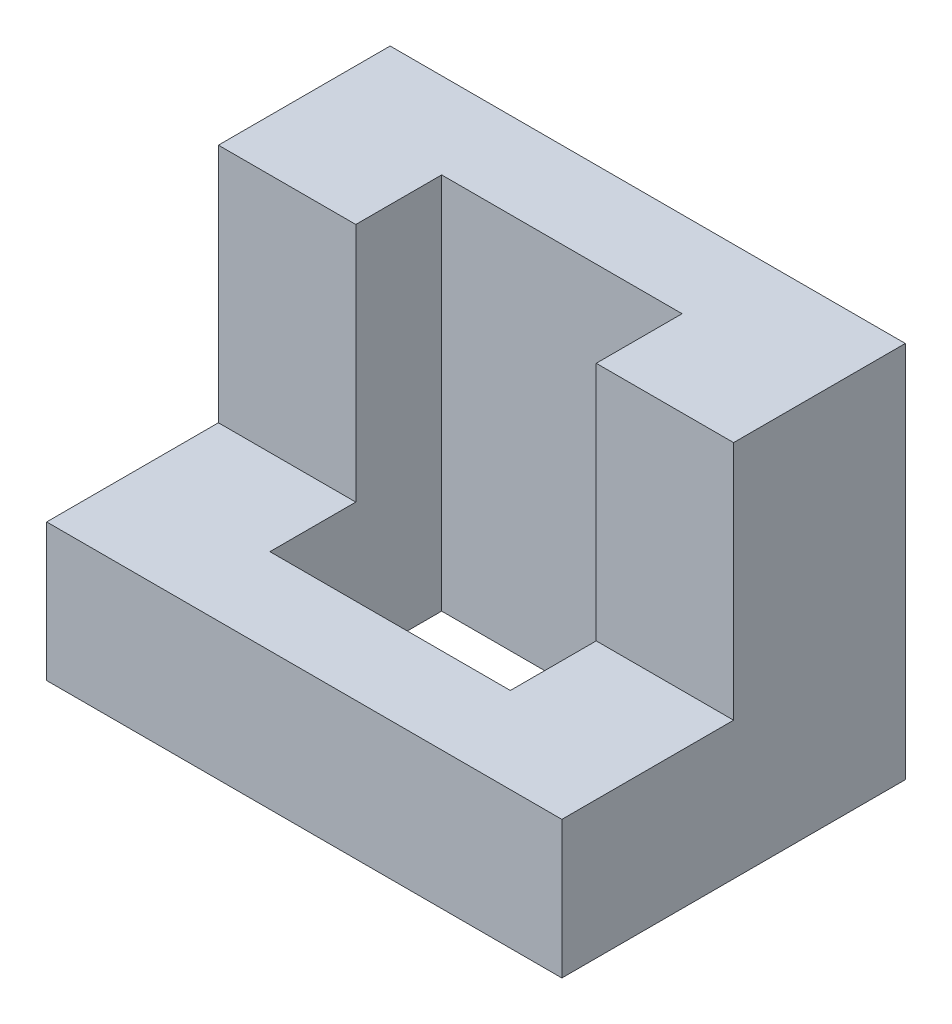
from build123d import *

# Parameters (mm, degrees)
SKETCH_1_W          = 30
SKETCH_1_H          = 20
EXTRUDE_1_DEPTH     = 8
EXTRUDE_2_DEPTH     = 14
SKETCH_3_W          = 14
SKETCH_3_H          = 10
CUT_EXTRUDE_1_DEPTH = 39.678159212


with BuildPart() as part:
    # Sketch 1 → Extrude 1 (new body)
    with BuildSketch(Plane(origin=(0, 0, 0), x_dir=(1, 0, 0), z_dir=(0, 1, 0))):
        with Locations((15, 10)):
            Rectangle(SKETCH_1_W, SKETCH_1_H)
    extrude(amount=EXTRUDE_1_DEPTH)

    # Sketch 2 → Extrude 2 (add)
    with BuildSketch(Plane(origin=(0, 8, 0), x_dir=(1, 0, 0), z_dir=(0, 1, 0))):
        Polygon((8, 15), (22, 15), (22, 10), (30, 10), (30, 20), (0, 20), (0, 10), (8, 10), align=None)
    extrude(amount=EXTRUDE_2_DEPTH)

    # Sketch 3 → Cut-Extrude 1 (cut, through all)
    with BuildSketch(Plane(origin=(0, 8, 0), x_dir=(1, 0, 0), z_dir=(0, 1, 0))):
        with Locations((15, 10)):
            Rectangle(SKETCH_3_W, SKETCH_3_H)
    extrude(amount=-CUT_EXTRUDE_1_DEPTH, mode=Mode.SUBTRACT)


solid = part.part
